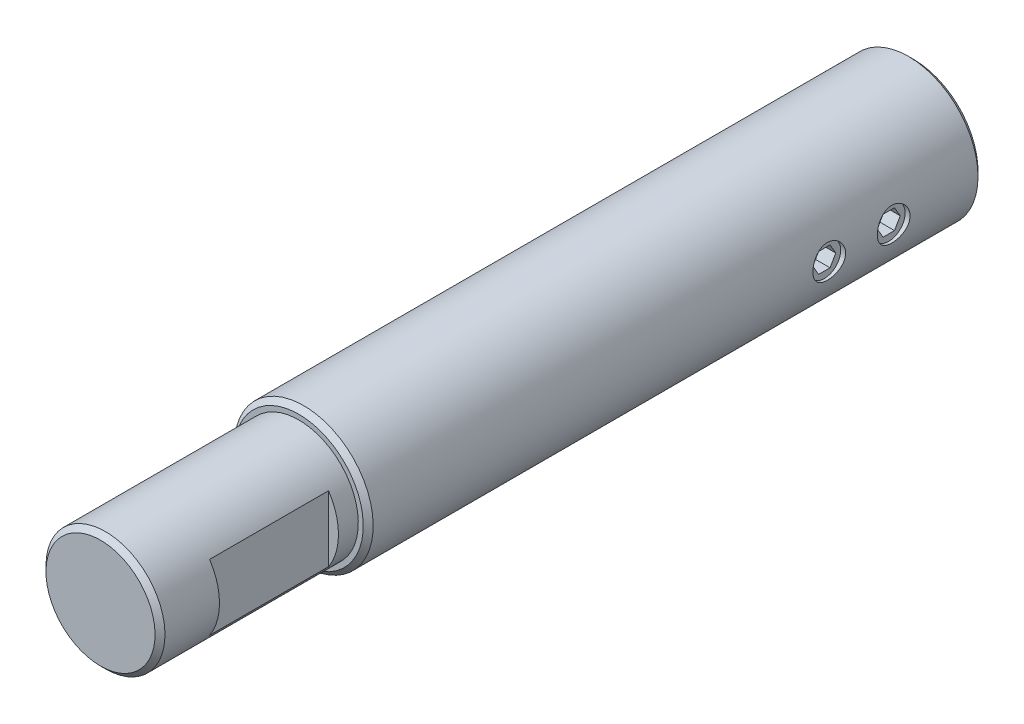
ISO-10303-21;
HEADER;
FILE_DESCRIPTION(('STEP AP214'),'2;1');
FILE_NAME('part.step','',(''),(''),'','','');
FILE_SCHEMA(('AUTOMOTIVE_DESIGN { 1 0 10303 214 1 1 1 1 }'));
ENDSEC;
DATA;
#1=APPLICATION_CONTEXT('core data for automotive mechanical design processes');
#2=APPLICATION_PROTOCOL_DEFINITION('international standard','automotive_design',2000,#1);
#3=PRODUCT_CONTEXT('',#1,'mechanical');
#4=PRODUCT('Part','Part','',(#3));
#5=PRODUCT_RELATED_PRODUCT_CATEGORY('part','',(#4));
#6=PRODUCT_DEFINITION_FORMATION('','',#4);
#7=PRODUCT_DEFINITION_CONTEXT('part definition',#1,'design');
#8=PRODUCT_DEFINITION('design','',#6,#7);
#9=PRODUCT_DEFINITION_SHAPE('','',#8);
#10=(LENGTH_UNIT() NAMED_UNIT(*) SI_UNIT(.MILLI.,.METRE.));
#11=(NAMED_UNIT(*) PLANE_ANGLE_UNIT() SI_UNIT($,.RADIAN.));
#12=(NAMED_UNIT(*) SI_UNIT($,.STERADIAN.) SOLID_ANGLE_UNIT());
#13=UNCERTAINTY_MEASURE_WITH_UNIT(LENGTH_MEASURE(1.E-05),#10,'distance_accuracy_value','');
#14=(GEOMETRIC_REPRESENTATION_CONTEXT(3) GLOBAL_UNCERTAINTY_ASSIGNED_CONTEXT((#13)) GLOBAL_UNIT_ASSIGNED_CONTEXT((#10,
#11,#12)) REPRESENTATION_CONTEXT('',''));
#15=CARTESIAN_POINT('',(0.,0.,0.));
#16=DIRECTION('',(0.,0.,1.));
#17=DIRECTION('',(1.,0.,0.));
#18=AXIS2_PLACEMENT_3D('',#15,#16,#17);
#19=CARTESIAN_POINT('',(0.,0.,0.));
#20=DIRECTION('',(0.,0.,-1.));
#21=DIRECTION('',(0.,-1.,0.));
#22=AXIS2_PLACEMENT_3D('',#19,#20,#21);
#23=CYLINDRICAL_SURFACE('',#22,6.);
#24=CARTESIAN_POINT('',(0.,0.,81.5));
#25=DIRECTION('',(0.,0.,-1.));
#26=DIRECTION('',(0.,-1.,0.));
#27=AXIS2_PLACEMENT_3D('',#24,#25,#26);
#28=CIRCLE('',#27,6.);
#29=CARTESIAN_POINT('',(0.,-6.,81.5));
#30=VERTEX_POINT('',#29);
#31=EDGE_CURVE('E435',#30,#30,#28,.T.);
#32=ORIENTED_EDGE('',*,*,#31,.T.);
#33=EDGE_LOOP('',(#32));
#34=FACE_BOUND('',#33,.T.);
#35=CARTESIAN_POINT('',(0.,0.,62.));
#36=DIRECTION('',(0.,0.,-1.));
#37=DIRECTION('',(0.,-1.,0.));
#38=AXIS2_PLACEMENT_3D('',#35,#36,#37);
#39=CIRCLE('',#38,6.);
#40=CARTESIAN_POINT('',(0.,-6.,62.));
#41=VERTEX_POINT('',#40);
#42=EDGE_CURVE('E456',#41,#41,#39,.T.);
#43=ORIENTED_EDGE('',*,*,#42,.F.);
#44=EDGE_LOOP('',(#43));
#45=FACE_BOUND('',#44,.T.);
#46=CARTESIAN_POINT('',(0.,0.,64.));
#47=DIRECTION('',(0.,0.,1.));
#48=DIRECTION('',(0.,1.,0.));
#49=AXIS2_PLACEMENT_3D('',#46,#47,#48);
#50=CIRCLE('',#49,6.);
#51=CARTESIAN_POINT('',(5.,-3.3166247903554,64.));
#52=VERTEX_POINT('',#51);
#53=CARTESIAN_POINT('',(5.,3.3166247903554,64.));
#54=VERTEX_POINT('',#53);
#55=EDGE_CURVE('E104',#52,#54,#50,.T.);
#56=ORIENTED_EDGE('',*,*,#55,.F.);
#57=DIRECTION('',(0.,0.,1.));
#58=VECTOR('',#57,1.);
#59=CARTESIAN_POINT('',(5.,-3.3166247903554,64.));
#60=LINE('',#59,#58);
#61=CARTESIAN_POINT('',(5.,-3.3166247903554,76.));
#62=VERTEX_POINT('',#61);
#63=EDGE_CURVE('E101',#52,#62,#60,.T.);
#64=ORIENTED_EDGE('',*,*,#63,.T.);
#65=CARTESIAN_POINT('',(0.,0.,76.));
#66=DIRECTION('',(0.,0.,1.));
#67=DIRECTION('',(0.,1.,0.));
#68=AXIS2_PLACEMENT_3D('',#65,#66,#67);
#69=CIRCLE('',#68,6.);
#70=CARTESIAN_POINT('',(5.,3.3166247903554,76.));
#71=VERTEX_POINT('',#70);
#72=EDGE_CURVE('E89',#62,#71,#69,.T.);
#73=ORIENTED_EDGE('',*,*,#72,.T.);
#74=DIRECTION('',(0.,0.,1.));
#75=VECTOR('',#74,1.);
#76=CARTESIAN_POINT('',(5.,3.3166247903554,64.));
#77=LINE('',#76,#75);
#78=EDGE_CURVE('E103',#54,#71,#77,.T.);
#79=ORIENTED_EDGE('',*,*,#78,.F.);
#80=EDGE_LOOP('',(#56,#64,#73,#79));
#81=FACE_BOUND('',#80,.T.);
#82=ADVANCED_FACE('F14',(#34,#45,#81),#23,.T.);
#83=CARTESIAN_POINT('',(0.,0.,0.));
#84=DIRECTION('',(0.,0.,-1.));
#85=DIRECTION('',(0.,-1.,0.));
#86=AXIS2_PLACEMENT_3D('',#83,#84,#85);
#87=CYLINDRICAL_SURFACE('',#86,7.);
#88=CARTESIAN_POINT('',(0.,0.,0.5));
#89=DIRECTION('',(0.,0.,1.));
#90=DIRECTION('',(0.,1.,0.));
#91=AXIS2_PLACEMENT_3D('',#88,#89,#90);
#92=CIRCLE('',#91,7.);
#93=CARTESIAN_POINT('',(0.,7.,0.5));
#94=VERTEX_POINT('',#93);
#95=EDGE_CURVE('E439',#94,#94,#92,.T.);
#96=ORIENTED_EDGE('',*,*,#95,.T.);
#97=EDGE_LOOP('',(#96));
#98=FACE_BOUND('',#97,.T.);
#99=CARTESIAN_POINT('',(0.,0.,61.5));
#100=DIRECTION('',(0.,0.,-1.));
#101=DIRECTION('',(0.,-1.,0.));
#102=AXIS2_PLACEMENT_3D('',#99,#100,#101);
#103=CIRCLE('',#102,7.);
#104=CARTESIAN_POINT('',(0.,-7.,61.5));
#105=VERTEX_POINT('',#104);
#106=EDGE_CURVE('E444',#105,#105,#103,.T.);
#107=ORIENTED_EDGE('',*,*,#106,.T.);
#108=EDGE_LOOP('',(#107));
#109=FACE_BOUND('',#108,.T.);
#110=CARTESIAN_POINT('',(6.80275679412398,1.65,9.));
#111=CARTESIAN_POINT('',(6.80275861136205,1.64999713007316,8.90871099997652));
#112=CARTESIAN_POINT('',(6.80461440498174,1.64239813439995,8.8173890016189));
#113=CARTESIAN_POINT('',(6.81182064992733,1.61224414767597,8.63735543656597));
#114=CARTESIAN_POINT('',(6.81717336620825,1.58967946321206,8.54864560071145));
#115=CARTESIAN_POINT('',(6.83073431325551,1.53035515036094,8.37646648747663));
#116=CARTESIAN_POINT('',(6.83893911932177,1.49361254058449,8.2929910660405));
#117=CARTESIAN_POINT('',(6.85727558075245,1.40702581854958,8.13338346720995));
#118=CARTESIAN_POINT('',(6.86740726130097,1.3571815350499,8.05725138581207));
#119=CARTESIAN_POINT('',(6.88867782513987,1.24476461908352,7.91300017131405));
#120=CARTESIAN_POINT('',(6.89983131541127,1.18198309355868,7.84504595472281));
#121=CARTESIAN_POINT('',(6.92176152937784,1.04592427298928,7.72052828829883));
#122=CARTESIAN_POINT('',(6.93253822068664,0.972646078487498,7.66396581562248));
#123=CARTESIAN_POINT('',(6.95266103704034,0.816555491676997,7.56317303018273));
#124=CARTESIAN_POINT('',(6.96198791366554,0.733636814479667,7.51910313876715));
#125=CARTESIAN_POINT('',(6.97799434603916,0.561312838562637,7.44558709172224));
#126=CARTESIAN_POINT('',(6.98467424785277,0.471908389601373,7.41613902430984));
#127=CARTESIAN_POINT('',(6.99453084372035,0.290868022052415,7.37322629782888));
#128=CARTESIAN_POINT('',(6.99776875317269,0.199301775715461,7.35948200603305));
#129=CARTESIAN_POINT('',(7.00058928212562,0.0151097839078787,7.34749086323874));
#130=CARTESIAN_POINT('',(7.00017238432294,-0.0775158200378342,7.34924196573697));
#131=CARTESIAN_POINT('',(6.99577641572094,-0.259263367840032,7.36798740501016));
#132=CARTESIAN_POINT('',(6.99186783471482,-0.348418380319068,7.38468011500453));
#133=CARTESIAN_POINT('',(6.98100889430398,-0.52262462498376,7.43235207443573));
#134=CARTESIAN_POINT('',(6.97405838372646,-0.607675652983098,7.46333203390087));
#135=CARTESIAN_POINT('',(6.95778608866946,-0.77207438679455,7.53895377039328));
#136=CARTESIAN_POINT('',(6.94844521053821,-0.851369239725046,7.58370617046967));
#137=CARTESIAN_POINT('',(6.92841069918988,-1.00143136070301,7.68551922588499));
#138=CARTESIAN_POINT('',(6.91771685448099,-1.07219729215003,7.74258180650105));
#139=CARTESIAN_POINT('',(6.89584251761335,-1.20498965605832,7.86902452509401));
#140=CARTESIAN_POINT('',(6.884656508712,-1.26676421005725,7.93866849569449));
#141=CARTESIAN_POINT('',(6.8632971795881,-1.37780936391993,8.0874443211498));
#142=CARTESIAN_POINT('',(6.85312389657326,-1.42707950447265,8.16657652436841));
#143=CARTESIAN_POINT('',(6.83492437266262,-1.51185477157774,8.33253525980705));
#144=CARTESIAN_POINT('',(6.82690665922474,-1.54730546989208,8.41939059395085));
#145=CARTESIAN_POINT('',(6.8140390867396,-1.6030277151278,8.59806127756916));
#146=CARTESIAN_POINT('',(6.80918863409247,-1.62330210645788,8.68987569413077));
#147=CARTESIAN_POINT('',(6.80332774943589,-1.64769127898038,8.87353855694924));
#148=CARTESIAN_POINT('',(6.80222947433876,-1.65217579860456,8.96533515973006));
#149=CARTESIAN_POINT('',(6.80375919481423,-1.64586488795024,9.14836457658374));
#150=CARTESIAN_POINT('',(6.80638688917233,-1.63507069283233,9.23959743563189));
#151=CARTESIAN_POINT('',(6.81498886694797,-1.59883140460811,9.41757745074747));
#152=CARTESIAN_POINT('',(6.82091521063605,-1.57359604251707,9.50436984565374));
#153=CARTESIAN_POINT('',(6.83540229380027,-1.50942069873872,9.67249368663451));
#154=CARTESIAN_POINT('',(6.84396331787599,-1.47047923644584,9.75382454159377));
#155=CARTESIAN_POINT('',(6.86294389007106,-1.37920410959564,9.91029905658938));
#156=CARTESIAN_POINT('',(6.87339357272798,-1.32664621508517,9.98530818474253));
#157=CARTESIAN_POINT('',(6.89489755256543,-1.20991829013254,10.1255780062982));
#158=CARTESIAN_POINT('',(6.90595193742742,-1.14574657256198,10.1908372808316));
#159=CARTESIAN_POINT('',(6.92771364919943,-1.00592681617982,10.3112229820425));
#160=CARTESIAN_POINT('',(6.93840801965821,-0.930057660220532,10.3660953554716));
#161=CARTESIAN_POINT('',(6.95799159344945,-0.769965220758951,10.4623180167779));
#162=CARTESIAN_POINT('',(6.96688088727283,-0.685742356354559,10.503668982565));
#163=CARTESIAN_POINT('',(6.9817988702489,-0.511894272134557,10.5713378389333));
#164=CARTESIAN_POINT('',(6.98784709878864,-0.422310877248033,10.5977586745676));
#165=CARTESIAN_POINT('',(6.99648655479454,-0.239816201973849,10.6351328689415));
#166=CARTESIAN_POINT('',(6.99907837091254,-0.146905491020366,10.6460888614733));
#167=CARTESIAN_POINT('',(7.00049202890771,0.0372082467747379,10.6520881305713));
#168=CARTESIAN_POINT('',(6.9994031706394,0.128398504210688,10.647508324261));
#169=CARTESIAN_POINT('',(6.99377268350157,0.308670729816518,10.6234197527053));
#170=CARTESIAN_POINT('',(6.98923113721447,0.397752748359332,10.6039113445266));
#171=CARTESIAN_POINT('',(6.97721604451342,0.570933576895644,10.5507117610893));
#172=CARTESIAN_POINT('',(6.96975517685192,0.655052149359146,10.5170818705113));
#173=CARTESIAN_POINT('',(6.95269208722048,0.81649879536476,10.4366509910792));
#174=CARTESIAN_POINT('',(6.94308962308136,0.893826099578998,10.3898485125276));
#175=CARTESIAN_POINT('',(6.92252474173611,1.04130725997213,10.2832139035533));
#176=CARTESIAN_POINT('',(6.91153737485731,1.11126948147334,10.2231215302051));
#177=CARTESIAN_POINT('',(6.88956325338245,1.24024523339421,10.0921276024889));
#178=CARTESIAN_POINT('',(6.8785764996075,1.29925605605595,10.0212233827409));
#179=CARTESIAN_POINT('',(6.85764827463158,1.40557849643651,9.86924540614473));
#180=CARTESIAN_POINT('',(6.84772646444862,1.45268661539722,9.7880263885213));
#181=CARTESIAN_POINT('',(6.83030721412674,1.53250931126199,9.61860266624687));
#182=CARTESIAN_POINT('',(6.82280787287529,1.56523518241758,9.53040350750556));
#183=CARTESIAN_POINT('',(6.81235745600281,1.61002842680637,9.36853084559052));
#184=CARTESIAN_POINT('',(6.80878274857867,1.62498700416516,9.29568399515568));
#185=CARTESIAN_POINT('',(6.8039817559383,1.64497362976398,9.14856531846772));
#186=CARTESIAN_POINT('',(6.80275531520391,1.65000233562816,9.07429358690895));
#187=CARTESIAN_POINT('',(6.80275679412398,1.65,9.));
#188=B_SPLINE_CURVE_WITH_KNOTS('',3,(#110,#111,#112,#113,#114,#115,#116,#117,#118,#119,#120,
#121,#122,#123,#124,#125,#126,#127,#128,#129,#130,#131,#132,#133,#134,#135,#136,#137,#138,#139,
#140,#141,#142,#143,#144,#145,#146,#147,#148,#149,#150,#151,#152,#153,#154,#155,#156,#157,#158,
#159,#160,#161,#162,#163,#164,#165,#166,#167,#168,#169,#170,#171,#172,#173,#174,#175,#176,#177,
#178,#179,#180,#181,#182,#183,#184,#185,#186,#187),.UNSPECIFIED.,.T.,.F.,(4,2,2,2,2,2,2,2,2,2,2,
2,2,2,2,2,2,2,2,2,2,2,2,2,2,2,2,2,2,2,2,2,2,2,2,2,2,2,4),(0.,0.273594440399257,
0.547366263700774,0.820810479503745,1.0942582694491,1.37252656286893,1.65081871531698,
1.9325374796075,2.21421939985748,2.49080324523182,2.76735056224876,3.03843805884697,
3.30953902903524,3.58287702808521,3.85625780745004,4.13623055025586,4.41621357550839,
4.69728844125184,4.97831061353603,5.25270687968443,5.52708096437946,5.79756789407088,
6.06808405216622,6.34337456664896,6.61870510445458,6.90008328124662,7.18144734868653,
7.46084693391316,7.74019892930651,8.01282246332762,8.28543947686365,8.55688541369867,
8.82836206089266,9.10571835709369,9.38314313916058,9.66503130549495,9.9466977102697,
10.1693714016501,10.3920303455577),.UNSPECIFIED.);
#189=CARTESIAN_POINT('',(6.80275679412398,1.65,9.));
#190=VERTEX_POINT('',#189);
#191=EDGE_CURVE('E107',#190,#190,#188,.T.);
#192=ORIENTED_EDGE('',*,*,#191,.T.);
#193=EDGE_LOOP('',(#192));
#194=FACE_BOUND('',#193,.T.);
#195=CARTESIAN_POINT('',(6.80275679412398,1.65,15.5));
#196=CARTESIAN_POINT('',(6.80275861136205,1.64999713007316,15.4087109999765));
#197=CARTESIAN_POINT('',(6.80461440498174,1.64239813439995,15.3173890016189));
#198=CARTESIAN_POINT('',(6.81182064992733,1.61224414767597,15.137355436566));
#199=CARTESIAN_POINT('',(6.81717336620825,1.58967946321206,15.0486456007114));
#200=CARTESIAN_POINT('',(6.83073431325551,1.53035515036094,14.8764664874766));
#201=CARTESIAN_POINT('',(6.83893911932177,1.49361254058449,14.7929910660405));
#202=CARTESIAN_POINT('',(6.85727558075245,1.40702581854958,14.63338346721));
#203=CARTESIAN_POINT('',(6.86740726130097,1.3571815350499,14.5572513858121));
#204=CARTESIAN_POINT('',(6.88867782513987,1.24476461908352,14.4130001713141));
#205=CARTESIAN_POINT('',(6.89983131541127,1.18198309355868,14.3450459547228));
#206=CARTESIAN_POINT('',(6.92176152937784,1.04592427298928,14.2205282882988));
#207=CARTESIAN_POINT('',(6.93253822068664,0.972646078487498,14.1639658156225));
#208=CARTESIAN_POINT('',(6.95266103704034,0.816555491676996,14.0631730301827));
#209=CARTESIAN_POINT('',(6.96198791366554,0.733636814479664,14.0191031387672));
#210=CARTESIAN_POINT('',(6.97799434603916,0.561312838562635,13.9455870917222));
#211=CARTESIAN_POINT('',(6.98467424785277,0.471908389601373,13.9161390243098));
#212=CARTESIAN_POINT('',(6.99453084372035,0.290868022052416,13.8732262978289));
#213=CARTESIAN_POINT('',(6.99776875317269,0.199301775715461,13.859482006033));
#214=CARTESIAN_POINT('',(7.00058928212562,0.0151097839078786,13.8474908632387));
#215=CARTESIAN_POINT('',(7.00017238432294,-0.077515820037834,13.849241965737));
#216=CARTESIAN_POINT('',(6.99577641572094,-0.259263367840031,13.8679874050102));
#217=CARTESIAN_POINT('',(6.99186783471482,-0.348418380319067,13.8846801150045));
#218=CARTESIAN_POINT('',(6.98100889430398,-0.522624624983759,13.9323520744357));
#219=CARTESIAN_POINT('',(6.97405838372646,-0.607675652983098,13.9633320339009));
#220=CARTESIAN_POINT('',(6.95778608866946,-0.772074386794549,14.0389537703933));
#221=CARTESIAN_POINT('',(6.94844521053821,-0.851369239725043,14.0837061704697));
#222=CARTESIAN_POINT('',(6.92841069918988,-1.001431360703,14.185519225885));
#223=CARTESIAN_POINT('',(6.91771685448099,-1.07219729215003,14.242581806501));
#224=CARTESIAN_POINT('',(6.89584251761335,-1.20498965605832,14.369024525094));
#225=CARTESIAN_POINT('',(6.88465650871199,-1.26676421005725,14.4386684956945));
#226=CARTESIAN_POINT('',(6.8632971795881,-1.37780936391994,14.5874443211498));
#227=CARTESIAN_POINT('',(6.85312389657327,-1.42707950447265,14.6665765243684));
#228=CARTESIAN_POINT('',(6.83492437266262,-1.51185477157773,14.8325352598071));
#229=CARTESIAN_POINT('',(6.82690665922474,-1.54730546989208,14.9193905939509));
#230=CARTESIAN_POINT('',(6.8140390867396,-1.6030277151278,15.0980612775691));
#231=CARTESIAN_POINT('',(6.80918863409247,-1.62330210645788,15.1898756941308));
#232=CARTESIAN_POINT('',(6.80332774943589,-1.64769127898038,15.3735385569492));
#233=CARTESIAN_POINT('',(6.80222947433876,-1.65217579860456,15.4653351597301));
#234=CARTESIAN_POINT('',(6.80375919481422,-1.64586488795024,15.6483645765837));
#235=CARTESIAN_POINT('',(6.80638688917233,-1.63507069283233,15.7395974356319));
#236=CARTESIAN_POINT('',(6.81498886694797,-1.59883140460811,15.9175774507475));
#237=CARTESIAN_POINT('',(6.82091521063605,-1.57359604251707,16.0043698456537));
#238=CARTESIAN_POINT('',(6.83540229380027,-1.50942069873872,16.1724936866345));
#239=CARTESIAN_POINT('',(6.843963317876,-1.47047923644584,16.2538245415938));
#240=CARTESIAN_POINT('',(6.86294389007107,-1.37920410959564,16.4102990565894));
#241=CARTESIAN_POINT('',(6.87339357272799,-1.32664621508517,16.4853081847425));
#242=CARTESIAN_POINT('',(6.89489755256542,-1.20991829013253,16.6255780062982));
#243=CARTESIAN_POINT('',(6.90595193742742,-1.14574657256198,16.6908372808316));
#244=CARTESIAN_POINT('',(6.92771364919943,-1.00592681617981,16.8112229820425));
#245=CARTESIAN_POINT('',(6.93840801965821,-0.930057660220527,16.8660953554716));
#246=CARTESIAN_POINT('',(6.95799159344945,-0.769965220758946,16.9623180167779));
#247=CARTESIAN_POINT('',(6.96688088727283,-0.685742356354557,17.003668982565));
#248=CARTESIAN_POINT('',(6.9817988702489,-0.511894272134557,17.0713378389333));
#249=CARTESIAN_POINT('',(6.98784709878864,-0.422310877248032,17.0977586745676));
#250=CARTESIAN_POINT('',(6.99648655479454,-0.239816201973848,17.1351328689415));
#251=CARTESIAN_POINT('',(6.99907837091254,-0.146905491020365,17.1460888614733));
#252=CARTESIAN_POINT('',(7.00049202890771,0.0372082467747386,17.1520881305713));
#253=CARTESIAN_POINT('',(6.9994031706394,0.12839850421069,17.147508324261));
#254=CARTESIAN_POINT('',(6.99377268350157,0.30867072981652,17.1234197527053));
#255=CARTESIAN_POINT('',(6.98923113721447,0.397752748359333,17.1039113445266));
#256=CARTESIAN_POINT('',(6.97721604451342,0.570933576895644,17.0507117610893));
#257=CARTESIAN_POINT('',(6.96975517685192,0.655052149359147,17.0170818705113));
#258=CARTESIAN_POINT('',(6.95269208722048,0.816498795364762,16.9366509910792));
#259=CARTESIAN_POINT('',(6.94308962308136,0.893826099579,16.8898485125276));
#260=CARTESIAN_POINT('',(6.92252474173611,1.04130725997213,16.7832139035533));
#261=CARTESIAN_POINT('',(6.91153737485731,1.11126948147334,16.7231215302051));
#262=CARTESIAN_POINT('',(6.88956325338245,1.24024523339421,16.5921276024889));
#263=CARTESIAN_POINT('',(6.87857649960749,1.29925605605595,16.5212233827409));
#264=CARTESIAN_POINT('',(6.85764827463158,1.40557849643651,16.3692454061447));
#265=CARTESIAN_POINT('',(6.84772646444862,1.45268661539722,16.2880263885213));
#266=CARTESIAN_POINT('',(6.83030721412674,1.53250931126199,16.1186026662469));
#267=CARTESIAN_POINT('',(6.82280787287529,1.56523518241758,16.0304035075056));
#268=CARTESIAN_POINT('',(6.81235745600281,1.61002842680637,15.8685308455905));
#269=CARTESIAN_POINT('',(6.80878274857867,1.62498700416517,15.7956839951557));
#270=CARTESIAN_POINT('',(6.8039817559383,1.64497362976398,15.6485653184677));
#271=CARTESIAN_POINT('',(6.80275531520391,1.65000233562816,15.574293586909));
#272=CARTESIAN_POINT('',(6.80275679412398,1.65,15.5));
#273=B_SPLINE_CURVE_WITH_KNOTS('',3,(#195,#196,#197,#198,#199,#200,#201,#202,#203,#204,#205,
#206,#207,#208,#209,#210,#211,#212,#213,#214,#215,#216,#217,#218,#219,#220,#221,#222,#223,#224,
#225,#226,#227,#228,#229,#230,#231,#232,#233,#234,#235,#236,#237,#238,#239,#240,#241,#242,#243,
#244,#245,#246,#247,#248,#249,#250,#251,#252,#253,#254,#255,#256,#257,#258,#259,#260,#261,#262,
#263,#264,#265,#266,#267,#268,#269,#270,#271,#272),.UNSPECIFIED.,.T.,.F.,(4,2,2,2,2,2,2,2,2,2,2,
2,2,2,2,2,2,2,2,2,2,2,2,2,2,2,2,2,2,2,2,2,2,2,2,2,2,2,4),(0.,0.273594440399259,
0.547366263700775,0.820810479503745,1.0942582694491,1.37252656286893,1.65081871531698,
1.9325374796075,2.21421939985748,2.49080324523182,2.76735056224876,3.03843805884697,
3.30953902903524,3.5828770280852,3.85625780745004,4.13623055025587,4.4162135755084,
4.69728844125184,4.97831061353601,5.25270687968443,5.52708096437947,5.79756789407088,
6.06808405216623,6.34337456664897,6.61870510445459,6.90008328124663,7.18144734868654,
7.46084693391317,7.74019892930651,8.01282246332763,8.28543947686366,8.55688541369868,
8.82836206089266,9.10571835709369,9.38314313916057,9.66503130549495,9.94669771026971,
10.1693714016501,10.3920303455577),.UNSPECIFIED.);
#274=CARTESIAN_POINT('',(6.80275679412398,1.65,15.5));
#275=VERTEX_POINT('',#274);
#276=EDGE_CURVE('E110',#275,#275,#273,.T.);
#277=ORIENTED_EDGE('',*,*,#276,.T.);
#278=EDGE_LOOP('',(#277));
#279=FACE_BOUND('',#278,.T.);
#280=ADVANCED_FACE('F125',(#98,#109,#194,#279),#87,.T.);
#281=CARTESIAN_POINT('',(-6.,0.,82.));
#282=DIRECTION('',(0.,0.,-1.));
#283=DIRECTION('',(0.,-1.,0.));
#284=AXIS2_PLACEMENT_3D('',#281,#282,#283);
#285=PLANE('',#284);
#286=CARTESIAN_POINT('',(0.,0.,82.));
#287=DIRECTION('',(0.,0.,-1.));
#288=DIRECTION('',(0.,-1.,0.));
#289=AXIS2_PLACEMENT_3D('',#286,#287,#288);
#290=CIRCLE('',#289,5.5);
#291=CARTESIAN_POINT('',(0.,-5.5,82.));
#292=VERTEX_POINT('',#291);
#293=EDGE_CURVE('E431',#292,#292,#290,.F.);
#294=ORIENTED_EDGE('',*,*,#293,.T.);
#295=EDGE_LOOP('',(#294));
#296=FACE_BOUND('',#295,.T.);
#297=ADVANCED_FACE('F467',(#296),#285,.F.);
#298=CARTESIAN_POINT('',(-7.,0.,62.));
#299=DIRECTION('',(0.,0.,-1.));
#300=DIRECTION('',(0.,-1.,0.));
#301=AXIS2_PLACEMENT_3D('',#298,#299,#300);
#302=PLANE('',#301);
#303=CARTESIAN_POINT('',(0.,0.,62.));
#304=DIRECTION('',(0.,0.,-1.));
#305=DIRECTION('',(0.,-1.,0.));
#306=AXIS2_PLACEMENT_3D('',#303,#304,#305);
#307=CIRCLE('',#306,6.5);
#308=CARTESIAN_POINT('',(0.,-6.5,62.));
#309=VERTEX_POINT('',#308);
#310=EDGE_CURVE('E18',#309,#309,#307,.F.);
#311=ORIENTED_EDGE('',*,*,#310,.T.);
#312=EDGE_LOOP('',(#311));
#313=FACE_BOUND('',#312,.T.);
#314=ORIENTED_EDGE('',*,*,#42,.T.);
#315=EDGE_LOOP('',(#314));
#316=FACE_BOUND('',#315,.T.);
#317=ADVANCED_FACE('F473',(#313,#316),#302,.F.);
#318=CARTESIAN_POINT('',(-4.,0.,0.));
#319=DIRECTION('',(0.,0.,1.));
#320=DIRECTION('',(0.,1.,0.));
#321=AXIS2_PLACEMENT_3D('',#318,#319,#320);
#322=PLANE('',#321);
#323=CARTESIAN_POINT('',(0.,0.,0.));
#324=DIRECTION('',(0.,0.,1.));
#325=DIRECTION('',(0.,1.,0.));
#326=AXIS2_PLACEMENT_3D('',#323,#324,#325);
#327=CIRCLE('',#326,6.5);
#328=CARTESIAN_POINT('',(0.,6.5,0.));
#329=VERTEX_POINT('',#328);
#330=EDGE_CURVE('E447',#329,#329,#327,.F.);
#331=ORIENTED_EDGE('',*,*,#330,.T.);
#332=EDGE_LOOP('',(#331));
#333=FACE_BOUND('',#332,.T.);
#334=CARTESIAN_POINT('',(0.,0.,0.));
#335=DIRECTION('',(0.,0.,1.));
#336=DIRECTION('',(0.,1.,0.));
#337=AXIS2_PLACEMENT_3D('',#334,#335,#336);
#338=CIRCLE('',#337,4.57735026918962);
#339=CARTESIAN_POINT('',(0.,4.57735026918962,0.));
#340=VERTEX_POINT('',#339);
#341=EDGE_CURVE('E450',#340,#340,#338,.T.);
#342=ORIENTED_EDGE('',*,*,#341,.T.);
#343=EDGE_LOOP('',(#342));
#344=FACE_BOUND('',#343,.T.);
#345=ADVANCED_FACE('F143',(#333,#344),#322,.F.);
#346=CARTESIAN_POINT('',(0.,0.,0.));
#347=DIRECTION('',(0.,0.,-1.));
#348=DIRECTION('',(0.,-1.,0.));
#349=AXIS2_PLACEMENT_3D('',#346,#347,#348);
#350=CYLINDRICAL_SURFACE('',#349,4.);
#351=CARTESIAN_POINT('',(4.,0.,7.));
#352=CARTESIAN_POINT('',(3.99999426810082,-0.105143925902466,7.00000660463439));
#353=CARTESIAN_POINT('',(3.99580982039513,-0.210413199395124,7.00834014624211));
#354=CARTESIAN_POINT('',(3.97948312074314,-0.417840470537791,7.04130576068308));
#355=CARTESIAN_POINT('',(3.96732575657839,-0.519992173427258,7.06596878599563));
#356=CARTESIAN_POINT('',(3.93632558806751,-0.717867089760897,7.13038761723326));
#357=CARTESIAN_POINT('',(3.91750878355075,-0.813613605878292,7.17008476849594));
#358=CARTESIAN_POINT('',(3.87491553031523,-0.996945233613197,7.26314124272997));
#359=CARTESIAN_POINT('',(3.85113947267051,-1.08453098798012,7.31649948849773));
#360=CARTESIAN_POINT('',(3.79912516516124,-1.25501563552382,7.43903449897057));
#361=CARTESIAN_POINT('',(3.77070398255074,-1.33731042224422,7.50897295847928));
#362=CARTESIAN_POINT('',(3.71319940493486,-1.48955888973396,7.66104295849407));
#363=CARTESIAN_POINT('',(3.68411552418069,-1.55950316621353,7.74318370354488));
#364=CARTESIAN_POINT('',(3.62597902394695,-1.69050400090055,7.92496669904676));
#365=CARTESIAN_POINT('',(3.59710373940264,-1.75045067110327,8.02547219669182));
#366=CARTESIAN_POINT('',(3.54571957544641,-1.85233645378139,8.23673467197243));
#367=CARTESIAN_POINT('',(3.52320615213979,-1.89428842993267,8.34748425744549));
#368=CARTESIAN_POINT('',(3.48915734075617,-1.95626488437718,8.56933021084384));
#369=CARTESIAN_POINT('',(3.47704543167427,-1.97745171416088,8.68000890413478));
#370=CARTESIAN_POINT('',(3.46363779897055,-2.00085398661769,8.90395767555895));
#371=CARTESIAN_POINT('',(3.46233138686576,-2.00308817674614,9.01722508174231));
#372=CARTESIAN_POINT('',(3.47021860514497,-1.98937457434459,9.22857204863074));
#373=CARTESIAN_POINT('',(3.47817527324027,-1.97556911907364,9.3268480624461));
#374=CARTESIAN_POINT('',(3.50152457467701,-1.93387969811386,9.51944381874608));
#375=CARTESIAN_POINT('',(3.51691957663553,-1.9059912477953,9.61376229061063));
#376=CARTESIAN_POINT('',(3.55374952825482,-1.83641956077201,9.79845826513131));
#377=CARTESIAN_POINT('',(3.57531681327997,-1.79443013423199,9.88869279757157));
#378=CARTESIAN_POINT('',(3.62206808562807,-1.69808337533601,10.06126858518));
#379=CARTESIAN_POINT('',(3.64725369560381,-1.64372048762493,10.1436062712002));
#380=CARTESIAN_POINT('',(3.70226315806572,-1.51613210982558,10.3090425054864));
#381=CARTESIAN_POINT('',(3.73227020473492,-1.44138891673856,10.3909137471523));
#382=CARTESIAN_POINT('',(3.79095246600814,-1.27911115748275,10.5414708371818));
#383=CARTESIAN_POINT('',(3.81962703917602,-1.19157051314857,10.6101503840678));
#384=CARTESIAN_POINT('',(3.87403974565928,-1.0010330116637,10.7353713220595));
#385=CARTESIAN_POINT('',(3.89957968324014,-0.897507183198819,10.7912009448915));
#386=CARTESIAN_POINT('',(3.94315762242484,-0.680932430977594,10.884194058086));
#387=CARTESIAN_POINT('',(3.96120157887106,-0.567891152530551,10.9213723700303));
#388=CARTESIAN_POINT('',(3.98648667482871,-0.345532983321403,10.9729508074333));
#389=CARTESIAN_POINT('',(3.9944987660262,-0.236683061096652,10.9889824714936));
#390=CARTESIAN_POINT('',(4.00146026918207,-0.0175591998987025,11.002929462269));
#391=CARTESIAN_POINT('',(4.00041397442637,0.0927140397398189,11.0008533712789));
#392=CARTESIAN_POINT('',(3.9898238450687,0.302465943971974,10.9795866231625));
#393=CARTESIAN_POINT('',(3.98094491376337,0.402118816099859,10.96173493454));
#394=CARTESIAN_POINT('',(3.9564434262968,0.596813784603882,10.9115238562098));
#395=CARTESIAN_POINT('',(3.94082012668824,0.691855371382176,10.879162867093));
#396=CARTESIAN_POINT('',(3.90368502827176,0.877777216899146,10.8000030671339));
#397=CARTESIAN_POINT('',(3.88201763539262,0.968460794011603,10.7528178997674));
#398=CARTESIAN_POINT('',(3.83487948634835,1.14092272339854,10.6457849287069));
#399=CARTESIAN_POINT('',(3.80940711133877,1.22269725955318,10.5859317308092));
#400=CARTESIAN_POINT('',(3.75416442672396,1.38353537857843,10.4484791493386));
#401=CARTESIAN_POINT('',(3.72421769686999,1.46154415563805,10.3697142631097));
#402=CARTESIAN_POINT('',(3.6652478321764,1.60371264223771,10.2001496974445));
#403=CARTESIAN_POINT('',(3.63622534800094,1.66786277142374,10.1093417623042));
#404=CARTESIAN_POINT('',(3.58102384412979,1.78341582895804,9.91271269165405));
#405=CARTESIAN_POINT('',(3.55505059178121,1.8340509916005,9.80637746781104));
#406=CARTESIAN_POINT('',(3.51148144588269,1.91616565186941,9.58497986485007));
#407=CARTESIAN_POINT('',(3.493874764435,1.94766983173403,9.46992894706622));
#408=CARTESIAN_POINT('',(3.47123002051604,1.98772337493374,9.24617955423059));
#409=CARTESIAN_POINT('',(3.4651476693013,1.9981859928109,9.13793149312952));
#410=CARTESIAN_POINT('',(3.46330709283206,2.00137830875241,8.92110586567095));
#411=CARTESIAN_POINT('',(3.4675443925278,1.99411569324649,8.81252846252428));
#412=CARTESIAN_POINT('',(3.48475724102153,1.96385225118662,8.60903299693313));
#413=CARTESIAN_POINT('',(3.49686188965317,1.94241662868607,8.51379905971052));
#414=CARTESIAN_POINT('',(3.52742032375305,1.88635071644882,8.32838376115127));
#415=CARTESIAN_POINT('',(3.54587615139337,1.85171618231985,8.23820403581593));
#416=CARTESIAN_POINT('',(3.58857060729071,1.76763149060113,8.05875029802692));
#417=CARTESIAN_POINT('',(3.61311444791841,1.7173422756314,7.96994419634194));
#418=CARTESIAN_POINT('',(3.66470663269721,1.60430194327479,7.80145092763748));
#419=CARTESIAN_POINT('',(3.69175627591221,1.54154434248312,7.72176853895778));
#420=CARTESIAN_POINT('',(3.74924646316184,1.39640665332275,7.56371603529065));
#421=CARTESIAN_POINT('',(3.77969966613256,1.31256884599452,7.48668179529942));
#422=CARTESIAN_POINT('',(3.83755504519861,1.1323096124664,7.34747403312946));
#423=CARTESIAN_POINT('',(3.8649555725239,1.0358814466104,7.28530852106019));
#424=CARTESIAN_POINT('',(3.91396019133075,0.831863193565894,7.17752727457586));
#425=CARTESIAN_POINT('',(3.93552192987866,0.724199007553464,7.13203166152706));
#426=CARTESIAN_POINT('',(3.97002682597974,0.501484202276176,7.06038366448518));
#427=CARTESIAN_POINT('',(3.98299446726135,0.386455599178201,7.03417630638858));
#428=CARTESIAN_POINT('',(3.99390923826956,0.225203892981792,7.01220517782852));
#429=CARTESIAN_POINT('',(3.99618730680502,0.180323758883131,7.00763471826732));
#430=CARTESIAN_POINT('',(3.99923393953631,0.0903034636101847,7.00153066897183));
#431=CARTESIAN_POINT('',(4.00000246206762,0.0451632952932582,6.99999716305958));
#432=CARTESIAN_POINT('',(4.,0.,7.));
#433=B_SPLINE_CURVE_WITH_KNOTS('',3,(#351,#352,#353,#354,#355,#356,#357,#358,#359,#360,#361,
#362,#363,#364,#365,#366,#367,#368,#369,#370,#371,#372,#373,#374,#375,#376,#377,#378,#379,#380,
#381,#382,#383,#384,#385,#386,#387,#388,#389,#390,#391,#392,#393,#394,#395,#396,#397,#398,#399,
#400,#401,#402,#403,#404,#405,#406,#407,#408,#409,#410,#411,#412,#413,#414,#415,#416,#417,#418,
#419,#420,#421,#422,#423,#424,#425,#426,#427,#428,#429,#430,#431,#432),.UNSPECIFIED.,.T.,.F.,(4,
2,2,2,2,2,2,2,2,2,2,2,2,2,2,2,2,2,2,2,2,2,2,2,2,2,2,2,2,2,2,2,2,2,2,2,2,2,2,2,4),(0.,
0.315248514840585,0.631096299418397,0.945724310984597,1.26032752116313,1.59396351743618,
1.92785247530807,2.28763452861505,2.64715895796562,2.98516024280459,3.32282714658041,
3.62011424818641,3.91749607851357,4.22180480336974,4.52625042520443,4.86929882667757,
5.21251069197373,5.57166044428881,5.93052433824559,6.25966580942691,6.58865129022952,
6.89213813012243,7.19565843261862,7.50785712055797,7.82018901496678,8.16319221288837,
8.50643177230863,8.86629364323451,9.22569023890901,9.55058615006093,9.87534119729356,
10.1691586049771,10.463070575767,10.7767291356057,11.0905512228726,11.4425048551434,
11.7946476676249,12.1492802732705,12.502898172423,12.6383056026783,12.7737167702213),.UNSPECIFIED.);
#434=CARTESIAN_POINT('',(4.,0.,7.));
#435=VERTEX_POINT('',#434);
#436=EDGE_CURVE('E9',#435,#435,#433,.T.);
#437=ORIENTED_EDGE('',*,*,#436,.F.);
#438=EDGE_LOOP('',(#437));
#439=FACE_BOUND('',#438,.T.);
#440=CARTESIAN_POINT('',(3.60555127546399,-1.73205080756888,16.5));
#441=CARTESIAN_POINT('',(3.63330072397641,-1.6742839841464,16.6000507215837));
#442=CARTESIAN_POINT('',(3.66340889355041,-1.60804520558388,16.6947282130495));
#443=CARTESIAN_POINT('',(3.72473015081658,-1.46040741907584,16.8713190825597));
#444=CARTESIAN_POINT('',(3.75594606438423,-1.37896698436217,16.9531964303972));
#445=CARTESIAN_POINT('',(3.81605659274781,-1.20265571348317,17.1021634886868));
#446=CARTESIAN_POINT('',(3.84495025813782,-1.10777942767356,17.1692471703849));
#447=CARTESIAN_POINT('',(3.8972467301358,-0.906764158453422,17.286416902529));
#448=CARTESIAN_POINT('',(3.92065575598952,-0.800638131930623,17.3365222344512));
#449=CARTESIAN_POINT('',(3.9585333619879,-0.584425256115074,17.416026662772));
#450=CARTESIAN_POINT('',(3.97332921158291,-0.474679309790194,17.4461906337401));
#451=CARTESIAN_POINT('',(3.99370450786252,-0.250836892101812,17.4874624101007));
#452=CARTESIAN_POINT('',(3.99928959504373,-0.136743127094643,17.4985818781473));
#453=CARTESIAN_POINT('',(4.00052059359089,0.0805769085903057,17.501038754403));
#454=CARTESIAN_POINT('',(3.99707902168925,0.183782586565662,17.4941923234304));
#455=CARTESIAN_POINT('',(3.98250691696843,0.387363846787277,17.4648216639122));
#456=CARTESIAN_POINT('',(3.97137663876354,0.487739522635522,17.4422979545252));
#457=CARTESIAN_POINT('',(3.94266442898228,0.681856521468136,17.3828878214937));
#458=CARTESIAN_POINT('',(3.92515694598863,0.775660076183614,17.3461668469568));
#459=CARTESIAN_POINT('',(3.88520912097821,0.955865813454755,17.259636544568));
#460=CARTESIAN_POINT('',(3.86276744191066,1.04226598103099,17.2098236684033));
#461=CARTESIAN_POINT('',(3.812752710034,1.21304818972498,17.0937543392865));
#462=CARTESIAN_POINT('',(3.78490681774,1.29664921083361,17.0264671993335));
#463=CARTESIAN_POINT('',(3.728106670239,1.45191920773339,16.8796249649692));
#464=CARTESIAN_POINT('',(3.69915157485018,1.5235789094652,16.8000604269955));
#465=CARTESIAN_POINT('',(3.64057503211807,1.65894331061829,16.6230841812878));
#466=CARTESIAN_POINT('',(3.61109645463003,1.72150029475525,16.5247407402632));
#467=CARTESIAN_POINT('',(3.55783946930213,1.82904300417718,16.3174433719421));
#468=CARTESIAN_POINT('',(3.53405805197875,1.87403801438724,16.2084950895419));
#469=CARTESIAN_POINT('',(3.49672204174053,1.94278435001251,15.9881247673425));
#470=CARTESIAN_POINT('',(3.48273910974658,1.96743518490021,15.8770599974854));
#471=CARTESIAN_POINT('',(3.46560346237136,1.9974778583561,15.651584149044));
#472=CARTESIAN_POINT('',(3.46243843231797,2.00289159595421,15.5371770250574));
#473=CARTESIAN_POINT('',(3.46715158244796,1.99470641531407,15.3235317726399));
#474=CARTESIAN_POINT('',(3.47371297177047,1.98337510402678,15.2241668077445));
#475=CARTESIAN_POINT('',(3.49462495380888,1.946289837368,15.0290176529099));
#476=CARTESIAN_POINT('',(3.50897787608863,1.92053156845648,14.9332345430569));
#477=CARTESIAN_POINT('',(3.54385710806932,1.85538137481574,14.7467342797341));
#478=CARTESIAN_POINT('',(3.56443473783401,1.81587568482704,14.6560669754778));
#479=CARTESIAN_POINT('',(3.60953060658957,1.72449452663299,14.4822728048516));
#480=CARTESIAN_POINT('',(3.63405047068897,1.67261395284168,14.3991490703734));
#481=CARTESIAN_POINT('',(3.68799561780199,1.55038171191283,14.2317903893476));
#482=CARTESIAN_POINT('',(3.71765053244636,1.47852991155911,14.148722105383));
#483=CARTESIAN_POINT('',(3.77614005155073,1.32202408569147,13.9952496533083));
#484=CARTESIAN_POINT('',(3.80497420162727,1.23736312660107,13.9248523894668));
#485=CARTESIAN_POINT('',(3.86059866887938,1.05152767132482,13.7947484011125));
#486=CARTESIAN_POINT('',(3.88717160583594,0.949677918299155,13.7359049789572));
#487=CARTESIAN_POINT('',(3.93323680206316,0.735911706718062,13.6365906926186));
#488=CARTESIAN_POINT('',(3.95273415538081,0.624002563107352,13.5961066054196));
#489=CARTESIAN_POINT('',(3.98116274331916,0.402329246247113,13.5377940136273));
#490=CARTESIAN_POINT('',(3.99078295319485,0.293045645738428,13.518480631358));
#491=CARTESIAN_POINT('',(4.00086617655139,0.0723913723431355,13.4982473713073));
#492=CARTESIAN_POINT('',(4.00133422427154,-0.038978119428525,13.497317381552));
#493=CARTESIAN_POINT('',(3.99342511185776,-0.250684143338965,13.5131740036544));
#494=CARTESIAN_POINT('',(3.98578495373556,-0.351163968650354,13.5284843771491));
#495=CARTESIAN_POINT('',(3.96353354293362,-0.547910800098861,13.5738670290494));
#496=CARTESIAN_POINT('',(3.94892168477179,-0.644177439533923,13.6039405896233));
#497=CARTESIAN_POINT('',(3.913702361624,-0.832015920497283,13.678418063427));
#498=CARTESIAN_POINT('',(3.89298402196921,-0.923460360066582,13.7230888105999));
#499=CARTESIAN_POINT('',(3.84746038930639,-1.09780664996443,13.8251754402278));
#500=CARTESIAN_POINT('',(3.8226535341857,-1.18070521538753,13.8825961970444));
#501=CARTESIAN_POINT('',(3.7684903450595,-1.34409113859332,14.0149054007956));
#502=CARTESIAN_POINT('',(3.73892591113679,-1.4235804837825,14.0909424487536));
#503=CARTESIAN_POINT('',(3.68019570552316,-1.5691832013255,14.2551235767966));
#504=CARTESIAN_POINT('',(3.65103025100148,-1.63528645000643,14.3432767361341));
#505=CARTESIAN_POINT('',(3.59461952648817,-1.75596318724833,14.5355287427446));
#506=CARTESIAN_POINT('',(3.56758483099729,-1.80964162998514,14.6402570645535));
#507=CARTESIAN_POINT('',(3.52130272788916,-1.8981438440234,14.8589674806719));
#508=CARTESIAN_POINT('',(3.50204587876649,-1.932990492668,14.972938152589));
#509=CARTESIAN_POINT('',(3.47575396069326,-1.97984906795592,15.1965246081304));
#510=CARTESIAN_POINT('',(3.46781075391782,-1.993566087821,15.3056728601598));
#511=CARTESIAN_POINT('',(3.46246101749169,-2.00284895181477,15.5250142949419));
#512=CARTESIAN_POINT('',(3.46505203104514,-1.99841902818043,15.6352072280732));
#513=CARTESIAN_POINT('',(3.47950788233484,-1.97311669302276,15.8412667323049));
#514=CARTESIAN_POINT('',(3.49037964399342,-1.95400322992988,15.9374308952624));
#515=CARTESIAN_POINT('',(3.51880052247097,-1.90234133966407,16.124928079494));
#516=CARTESIAN_POINT('',(3.53634159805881,-1.86980908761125,16.2162667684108));
#517=CARTESIAN_POINT('',(3.56384441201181,-1.81639360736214,16.3378952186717));
#518=CARTESIAN_POINT('',(3.57179420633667,-1.80072927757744,16.3710412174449));
#519=CARTESIAN_POINT('',(3.58826818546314,-1.76767464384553,16.4363030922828));
#520=CARTESIAN_POINT('',(3.5967922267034,-1.75028477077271,16.4684192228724));
#521=CARTESIAN_POINT('',(3.60555127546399,-1.73205080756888,16.5));
#522=B_SPLINE_CURVE_WITH_KNOTS('',3,(#440,#441,#442,#443,#444,#445,#446,#447,#448,#449,#450,
#451,#452,#453,#454,#455,#456,#457,#458,#459,#460,#461,#462,#463,#464,#465,#466,#467,#468,#469,
#470,#471,#472,#473,#474,#475,#476,#477,#478,#479,#480,#481,#482,#483,#484,#485,#486,#487,#488,
#489,#490,#491,#492,#493,#494,#495,#496,#497,#498,#499,#500,#501,#502,#503,#504,#505,#506,#507,
#508,#509,#510,#511,#512,#513,#514,#515,#516,#517,#518,#519,#520,#521),.UNSPECIFIED.,.T.,.F.,(4,
2,2,2,2,2,2,2,2,2,2,2,2,2,2,2,2,2,2,2,2,2,2,2,2,2,2,2,2,2,2,2,2,2,2,2,2,2,2,2,4),(0.,
0.356308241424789,0.713602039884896,1.07104117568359,1.42807301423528,1.77046340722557,
2.11264404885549,2.42159581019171,2.73053734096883,3.03598213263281,3.34150979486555,
3.67273609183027,4.00421844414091,4.3631099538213,4.72181146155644,5.06364450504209,
5.40508828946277,5.70432289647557,6.0036470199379,6.30550950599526,6.60749674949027,
6.94733596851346,7.28735980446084,7.64722090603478,8.00682241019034,8.33916195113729,
8.67131868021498,8.97567627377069,9.2800603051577,9.59035270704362,9.9007639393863,
10.2410177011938,10.581527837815,10.941857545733,11.301748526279,11.6307095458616,
11.9595938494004,12.2542549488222,12.5485618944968,12.6610577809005,12.7735256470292),.UNSPECIFIED.);
#523=CARTESIAN_POINT('',(3.60555127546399,-1.73205080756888,16.5));
#524=VERTEX_POINT('',#523);
#525=EDGE_CURVE('E147',#524,#524,#522,.T.);
#526=ORIENTED_EDGE('',*,*,#525,.F.);
#527=EDGE_LOOP('',(#526));
#528=FACE_BOUND('',#527,.T.);
#529=CARTESIAN_POINT('',(0.,0.,1.));
#530=DIRECTION('',(0.,0.,1.));
#531=DIRECTION('',(0.,1.,0.));
#532=AXIS2_PLACEMENT_3D('',#529,#530,#531);
#533=CIRCLE('',#532,4.);
#534=CARTESIAN_POINT('',(0.,4.,1.));
#535=VERTEX_POINT('',#534);
#536=EDGE_CURVE('E453',#535,#535,#533,.F.);
#537=ORIENTED_EDGE('',*,*,#536,.T.);
#538=EDGE_LOOP('',(#537));
#539=FACE_BOUND('',#538,.T.);
#540=CARTESIAN_POINT('',(0.,0.,25.));
#541=DIRECTION('',(0.,0.,-1.));
#542=DIRECTION('',(0.,-1.,0.));
#543=AXIS2_PLACEMENT_3D('',#540,#541,#542);
#544=CIRCLE('',#543,4.);
#545=CARTESIAN_POINT('',(0.,-4.,25.));
#546=VERTEX_POINT('',#545);
#547=EDGE_CURVE('E458',#546,#546,#544,.T.);
#548=ORIENTED_EDGE('',*,*,#547,.F.);
#549=EDGE_LOOP('',(#548));
#550=FACE_BOUND('',#549,.T.);
#551=ADVANCED_FACE('F139',(#439,#528,#539,#550),#350,.F.);
#552=CARTESIAN_POINT('',(7.,0.,15.5));
#553=DIRECTION('',(1.,0.,0.));
#554=DIRECTION('',(0.,1.,0.));
#555=AXIS2_PLACEMENT_3D('',#552,#553,#554);
#556=CYLINDRICAL_SURFACE('',#555,1.65);
#557=CARTESIAN_POINT('',(6.5,0.,15.5));
#558=DIRECTION('',(1.,0.,0.));
#559=DIRECTION('',(0.,0.,1.));
#560=AXIS2_PLACEMENT_3D('',#557,#558,#559);
#561=CIRCLE('',#560,1.65);
#562=CARTESIAN_POINT('',(6.5,0.,17.15));
#563=VERTEX_POINT('',#562);
#564=EDGE_CURVE('E361',#563,#563,#561,.T.);
#565=ORIENTED_EDGE('',*,*,#564,.F.);
#566=EDGE_LOOP('',(#565));
#567=FACE_BOUND('',#566,.T.);
#568=ORIENTED_EDGE('',*,*,#276,.F.);
#569=EDGE_LOOP('',(#568));
#570=FACE_BOUND('',#569,.T.);
#571=ADVANCED_FACE('F133',(#567,#570),#556,.F.);
#572=CARTESIAN_POINT('',(7.,0.,9.));
#573=DIRECTION('',(1.,0.,0.));
#574=DIRECTION('',(0.,1.,0.));
#575=AXIS2_PLACEMENT_3D('',#572,#573,#574);
#576=CYLINDRICAL_SURFACE('',#575,1.65);
#577=CARTESIAN_POINT('',(6.5,0.,9.));
#578=DIRECTION('',(1.,0.,0.));
#579=DIRECTION('',(0.,0.,1.));
#580=AXIS2_PLACEMENT_3D('',#577,#578,#579);
#581=CIRCLE('',#580,1.65);
#582=CARTESIAN_POINT('',(6.5,0.,10.65));
#583=VERTEX_POINT('',#582);
#584=EDGE_CURVE('E24',#583,#583,#581,.T.);
#585=ORIENTED_EDGE('',*,*,#584,.F.);
#586=EDGE_LOOP('',(#585));
#587=FACE_BOUND('',#586,.T.);
#588=ORIENTED_EDGE('',*,*,#191,.F.);
#589=EDGE_LOOP('',(#588));
#590=FACE_BOUND('',#589,.T.);
#591=ADVANCED_FACE('F129',(#587,#590),#576,.F.);
#592=CARTESIAN_POINT('',(5.,-3.3166247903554,64.));
#593=DIRECTION('',(-1.,0.,0.));
#594=DIRECTION('',(0.,-1.,0.));
#595=AXIS2_PLACEMENT_3D('',#592,#593,#594);
#596=PLANE('',#595);
#597=DIRECTION('',(0.,-1.,0.));
#598=VECTOR('',#597,1.);
#599=CARTESIAN_POINT('',(5.,-3.3166247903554,76.));
#600=LINE('',#599,#598);
#601=EDGE_CURVE('E92',#71,#62,#600,.T.);
#602=ORIENTED_EDGE('',*,*,#601,.T.);
#603=ORIENTED_EDGE('',*,*,#63,.F.);
#604=DIRECTION('',(0.,-1.,0.));
#605=VECTOR('',#604,1.);
#606=CARTESIAN_POINT('',(5.,-3.3166247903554,64.));
#607=LINE('',#606,#605);
#608=EDGE_CURVE('E112',#54,#52,#607,.T.);
#609=ORIENTED_EDGE('',*,*,#608,.F.);
#610=ORIENTED_EDGE('',*,*,#78,.T.);
#611=EDGE_LOOP('',(#602,#603,#609,#610));
#612=FACE_BOUND('',#611,.T.);
#613=ADVANCED_FACE('F99',(#612),#596,.F.);
#614=CARTESIAN_POINT('',(0.,0.,64.));
#615=DIRECTION('',(0.,0.,1.));
#616=DIRECTION('',(0.,1.,0.));
#617=AXIS2_PLACEMENT_3D('',#614,#615,#616);
#618=PLANE('',#617);
#619=ORIENTED_EDGE('',*,*,#55,.T.);
#620=ORIENTED_EDGE('',*,*,#608,.T.);
#621=EDGE_LOOP('',(#619,#620));
#622=FACE_BOUND('',#621,.T.);
#623=ADVANCED_FACE('F225',(#622),#618,.T.);
#624=CARTESIAN_POINT('',(0.,0.,76.));
#625=DIRECTION('',(0.,0.,1.));
#626=DIRECTION('',(0.,1.,0.));
#627=AXIS2_PLACEMENT_3D('',#624,#625,#626);
#628=PLANE('',#627);
#629=ORIENTED_EDGE('',*,*,#72,.F.);
#630=ORIENTED_EDGE('',*,*,#601,.F.);
#631=EDGE_LOOP('',(#629,#630));
#632=FACE_BOUND('',#631,.T.);
#633=ADVANCED_FACE('F91',(#632),#628,.F.);
#634=CARTESIAN_POINT('',(0.,0.,1.));
#635=DIRECTION('',(0.,0.,-1.));
#636=DIRECTION('',(0.,-1.,0.));
#637=AXIS2_PLACEMENT_3D('',#634,#635,#636);
#638=CONICAL_SURFACE('',#637,4.,0.523598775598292);
#639=ORIENTED_EDGE('',*,*,#341,.F.);
#640=EDGE_LOOP('',(#639));
#641=FACE_BOUND('',#640,.T.);
#642=ORIENTED_EDGE('',*,*,#536,.F.);
#643=EDGE_LOOP('',(#642));
#644=FACE_BOUND('',#643,.T.);
#645=ADVANCED_FACE('F229',(#641,#644),#638,.F.);
#646=CARTESIAN_POINT('',(0.,0.,0.));
#647=DIRECTION('',(0.,0.,1.));
#648=DIRECTION('',(0.,1.,0.));
#649=AXIS2_PLACEMENT_3D('',#646,#647,#648);
#650=CONICAL_SURFACE('',#649,6.5,0.785398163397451);
#651=ORIENTED_EDGE('',*,*,#95,.F.);
#652=EDGE_LOOP('',(#651));
#653=FACE_BOUND('',#652,.T.);
#654=ORIENTED_EDGE('',*,*,#330,.F.);
#655=EDGE_LOOP('',(#654));
#656=FACE_BOUND('',#655,.T.);
#657=ADVANCED_FACE('F234',(#653,#656),#650,.T.);
#658=CARTESIAN_POINT('',(0.,0.,81.5));
#659=DIRECTION('',(0.,0.,-1.));
#660=DIRECTION('',(0.,-1.,0.));
#661=AXIS2_PLACEMENT_3D('',#658,#659,#660);
#662=CONICAL_SURFACE('',#661,6.,0.785398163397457);
#663=ORIENTED_EDGE('',*,*,#293,.F.);
#664=EDGE_LOOP('',(#663));
#665=FACE_BOUND('',#664,.T.);
#666=ORIENTED_EDGE('',*,*,#31,.F.);
#667=EDGE_LOOP('',(#666));
#668=FACE_BOUND('',#667,.T.);
#669=ADVANCED_FACE('F485',(#665,#668),#662,.T.);
#670=CARTESIAN_POINT('',(0.,0.,61.5));
#671=DIRECTION('',(0.,0.,-1.));
#672=DIRECTION('',(0.,-1.,0.));
#673=AXIS2_PLACEMENT_3D('',#670,#671,#672);
#674=CONICAL_SURFACE('',#673,7.,0.785398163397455);
#675=ORIENTED_EDGE('',*,*,#310,.F.);
#676=EDGE_LOOP('',(#675));
#677=FACE_BOUND('',#676,.T.);
#678=ORIENTED_EDGE('',*,*,#106,.F.);
#679=EDGE_LOOP('',(#678));
#680=FACE_BOUND('',#679,.T.);
#681=ADVANCED_FACE('F16',(#677,#680),#674,.T.);
#682=CARTESIAN_POINT('',(5.,-1.,16.0773502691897));
#683=DIRECTION('',(1.,0.,0.));
#684=DIRECTION('',(0.,0.5,0.866025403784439));
#685=AXIS2_PLACEMENT_3D('',#682,#683,#684);
#686=PLANE('',#685);
#687=DIRECTION('',(0.,-0.866025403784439,-0.5));
#688=VECTOR('',#687,1.);
#689=CARTESIAN_POINT('',(5.,0.,16.6547005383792));
#690=LINE('',#689,#688);
#691=CARTESIAN_POINT('',(5.,0.,16.6547005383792));
#692=VERTEX_POINT('',#691);
#693=CARTESIAN_POINT('',(5.,-1.,16.0773502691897));
#694=VERTEX_POINT('',#693);
#695=EDGE_CURVE('E161',#692,#694,#690,.T.);
#696=ORIENTED_EDGE('',*,*,#695,.T.);
#697=DIRECTION('',(0.,0.,-1.));
#698=VECTOR('',#697,1.);
#699=CARTESIAN_POINT('',(5.,-1.,16.0773502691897));
#700=LINE('',#699,#698);
#701=CARTESIAN_POINT('',(5.,-1.,14.9226497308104));
#702=VERTEX_POINT('',#701);
#703=EDGE_CURVE('E415',#694,#702,#700,.T.);
#704=ORIENTED_EDGE('',*,*,#703,.T.);
#705=DIRECTION('',(0.,0.866025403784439,-0.5));
#706=VECTOR('',#705,1.);
#707=CARTESIAN_POINT('',(5.,-1.,14.9226497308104));
#708=LINE('',#707,#706);
#709=CARTESIAN_POINT('',(5.,0.,14.3452994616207));
#710=VERTEX_POINT('',#709);
#711=EDGE_CURVE('E413',#702,#710,#708,.T.);
#712=ORIENTED_EDGE('',*,*,#711,.T.);
#713=DIRECTION('',(0.,0.866025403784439,0.5));
#714=VECTOR('',#713,1.);
#715=CARTESIAN_POINT('',(5.,0.,14.3452994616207));
#716=LINE('',#715,#714);
#717=CARTESIAN_POINT('',(5.,1.,14.9226497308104));
#718=VERTEX_POINT('',#717);
#719=EDGE_CURVE('E410',#710,#718,#716,.T.);
#720=ORIENTED_EDGE('',*,*,#719,.T.);
#721=DIRECTION('',(0.,0.,1.));
#722=VECTOR('',#721,1.);
#723=CARTESIAN_POINT('',(5.,1.,14.9226497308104));
#724=LINE('',#723,#722);
#725=CARTESIAN_POINT('',(5.,1.,16.0773502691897));
#726=VERTEX_POINT('',#725);
#727=EDGE_CURVE('E407',#718,#726,#724,.T.);
#728=ORIENTED_EDGE('',*,*,#727,.T.);
#729=DIRECTION('',(0.,-0.866025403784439,0.5));
#730=VECTOR('',#729,1.);
#731=CARTESIAN_POINT('',(5.,1.,16.0773502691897));
#732=LINE('',#731,#730);
#733=EDGE_CURVE('E379',#726,#692,#732,.T.);
#734=ORIENTED_EDGE('',*,*,#733,.T.);
#735=EDGE_LOOP('',(#696,#704,#712,#720,#728,#734));
#736=FACE_BOUND('',#735,.T.);
#737=ADVANCED_FACE('F181',(#736),#686,.T.);
#738=CARTESIAN_POINT('',(5.,-1.,16.0773502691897));
#739=DIRECTION('',(0.,-1.,0.));
#740=DIRECTION('',(0.,0.,-1.));
#741=AXIS2_PLACEMENT_3D('',#738,#739,#740);
#742=PLANE('',#741);
#743=DIRECTION('',(0.,0.,-1.));
#744=VECTOR('',#743,1.);
#745=CARTESIAN_POINT('',(6.5,-1.,16.0773502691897));
#746=LINE('',#745,#744);
#747=CARTESIAN_POINT('',(6.5,-1.,16.0773502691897));
#748=VERTEX_POINT('',#747);
#749=CARTESIAN_POINT('',(6.5,-1.,14.9226497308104));
#750=VERTEX_POINT('',#749);
#751=EDGE_CURVE('E400',#748,#750,#746,.T.);
#752=ORIENTED_EDGE('',*,*,#751,.T.);
#753=DIRECTION('',(1.,0.,0.));
#754=VECTOR('',#753,1.);
#755=CARTESIAN_POINT('',(5.,-1.,14.9226497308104));
#756=LINE('',#755,#754);
#757=EDGE_CURVE('E378',#702,#750,#756,.T.);
#758=ORIENTED_EDGE('',*,*,#757,.F.);
#759=ORIENTED_EDGE('',*,*,#703,.F.);
#760=DIRECTION('',(1.,0.,0.));
#761=VECTOR('',#760,1.);
#762=CARTESIAN_POINT('',(5.,-1.,16.0773502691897));
#763=LINE('',#762,#761);
#764=EDGE_CURVE('E375',#694,#748,#763,.T.);
#765=ORIENTED_EDGE('',*,*,#764,.T.);
#766=EDGE_LOOP('',(#752,#758,#759,#765));
#767=FACE_BOUND('',#766,.T.);
#768=ADVANCED_FACE('F184',(#767),#742,.F.);
#769=CARTESIAN_POINT('',(5.,-1.,14.9226497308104));
#770=DIRECTION('',(0.,-0.5,-0.866025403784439));
#771=DIRECTION('',(1.,0.,0.));
#772=AXIS2_PLACEMENT_3D('',#769,#770,#771);
#773=PLANE('',#772);
#774=DIRECTION('',(0.,0.866025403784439,-0.5));
#775=VECTOR('',#774,1.);
#776=CARTESIAN_POINT('',(6.5,-1.,14.9226497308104));
#777=LINE('',#776,#775);
#778=CARTESIAN_POINT('',(6.5,0.,14.3452994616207));
#779=VERTEX_POINT('',#778);
#780=EDGE_CURVE('E397',#750,#779,#777,.T.);
#781=ORIENTED_EDGE('',*,*,#780,.T.);
#782=DIRECTION('',(1.,0.,0.));
#783=VECTOR('',#782,1.);
#784=CARTESIAN_POINT('',(5.,0.,14.3452994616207));
#785=LINE('',#784,#783);
#786=EDGE_CURVE('E381',#710,#779,#785,.T.);
#787=ORIENTED_EDGE('',*,*,#786,.F.);
#788=ORIENTED_EDGE('',*,*,#711,.F.);
#789=ORIENTED_EDGE('',*,*,#757,.T.);
#790=EDGE_LOOP('',(#781,#787,#788,#789));
#791=FACE_BOUND('',#790,.T.);
#792=ADVANCED_FACE('F198',(#791),#773,.F.);
#793=CARTESIAN_POINT('',(5.,0.,14.3452994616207));
#794=DIRECTION('',(0.,0.5,-0.866025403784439));
#795=DIRECTION('',(0.,0.866025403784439,0.5));
#796=AXIS2_PLACEMENT_3D('',#793,#794,#795);
#797=PLANE('',#796);
#798=DIRECTION('',(0.,0.866025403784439,0.5));
#799=VECTOR('',#798,1.);
#800=CARTESIAN_POINT('',(6.5,0.,14.3452994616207));
#801=LINE('',#800,#799);
#802=CARTESIAN_POINT('',(6.5,1.,14.9226497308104));
#803=VERTEX_POINT('',#802);
#804=EDGE_CURVE('E394',#779,#803,#801,.T.);
#805=ORIENTED_EDGE('',*,*,#804,.T.);
#806=DIRECTION('',(1.,0.,0.));
#807=VECTOR('',#806,1.);
#808=CARTESIAN_POINT('',(5.,1.,14.9226497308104));
#809=LINE('',#808,#807);
#810=EDGE_CURVE('E383',#718,#803,#809,.T.);
#811=ORIENTED_EDGE('',*,*,#810,.F.);
#812=ORIENTED_EDGE('',*,*,#719,.F.);
#813=ORIENTED_EDGE('',*,*,#786,.T.);
#814=EDGE_LOOP('',(#805,#811,#812,#813));
#815=FACE_BOUND('',#814,.T.);
#816=ADVANCED_FACE('F194',(#815),#797,.F.);
#817=CARTESIAN_POINT('',(5.,1.,14.9226497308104));
#818=DIRECTION('',(0.,1.,0.));
#819=DIRECTION('',(0.,0.,1.));
#820=AXIS2_PLACEMENT_3D('',#817,#818,#819);
#821=PLANE('',#820);
#822=DIRECTION('',(0.,0.,1.));
#823=VECTOR('',#822,1.);
#824=CARTESIAN_POINT('',(6.5,1.,14.9226497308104));
#825=LINE('',#824,#823);
#826=CARTESIAN_POINT('',(6.5,1.,16.0773502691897));
#827=VERTEX_POINT('',#826);
#828=EDGE_CURVE('E391',#803,#827,#825,.T.);
#829=ORIENTED_EDGE('',*,*,#828,.T.);
#830=DIRECTION('',(1.,0.,0.));
#831=VECTOR('',#830,1.);
#832=CARTESIAN_POINT('',(5.,1.,16.0773502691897));
#833=LINE('',#832,#831);
#834=EDGE_CURVE('E385',#726,#827,#833,.T.);
#835=ORIENTED_EDGE('',*,*,#834,.F.);
#836=ORIENTED_EDGE('',*,*,#727,.F.);
#837=ORIENTED_EDGE('',*,*,#810,.T.);
#838=EDGE_LOOP('',(#829,#835,#836,#837));
#839=FACE_BOUND('',#838,.T.);
#840=ADVANCED_FACE('F190',(#839),#821,.F.);
#841=CARTESIAN_POINT('',(5.,1.,16.0773502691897));
#842=DIRECTION('',(0.,0.5,0.866025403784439));
#843=DIRECTION('',(-1.,0.,0.));
#844=AXIS2_PLACEMENT_3D('',#841,#842,#843);
#845=PLANE('',#844);
#846=DIRECTION('',(0.,-0.866025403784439,0.5));
#847=VECTOR('',#846,1.);
#848=CARTESIAN_POINT('',(6.5,1.,16.0773502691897));
#849=LINE('',#848,#847);
#850=CARTESIAN_POINT('',(6.5,0.,16.6547005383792));
#851=VERTEX_POINT('',#850);
#852=EDGE_CURVE('E388',#827,#851,#849,.T.);
#853=ORIENTED_EDGE('',*,*,#852,.T.);
#854=DIRECTION('',(1.,0.,0.));
#855=VECTOR('',#854,1.);
#856=CARTESIAN_POINT('',(5.,0.,16.6547005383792));
#857=LINE('',#856,#855);
#858=EDGE_CURVE('E374',#692,#851,#857,.T.);
#859=ORIENTED_EDGE('',*,*,#858,.F.);
#860=ORIENTED_EDGE('',*,*,#733,.F.);
#861=ORIENTED_EDGE('',*,*,#834,.T.);
#862=EDGE_LOOP('',(#853,#859,#860,#861));
#863=FACE_BOUND('',#862,.T.);
#864=ADVANCED_FACE('F186',(#863),#845,.F.);
#865=CARTESIAN_POINT('',(5.,0.,16.6547005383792));
#866=DIRECTION('',(0.,-0.5,0.866025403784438));
#867=DIRECTION('',(0.,-0.866025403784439,-0.5));
#868=AXIS2_PLACEMENT_3D('',#865,#866,#867);
#869=PLANE('',#868);
#870=DIRECTION('',(0.,-0.866025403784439,-0.5));
#871=VECTOR('',#870,1.);
#872=CARTESIAN_POINT('',(6.5,0.,16.6547005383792));
#873=LINE('',#872,#871);
#874=EDGE_CURVE('E403',#851,#748,#873,.T.);
#875=ORIENTED_EDGE('',*,*,#874,.T.);
#876=ORIENTED_EDGE('',*,*,#764,.F.);
#877=ORIENTED_EDGE('',*,*,#695,.F.);
#878=ORIENTED_EDGE('',*,*,#858,.T.);
#879=EDGE_LOOP('',(#875,#876,#877,#878));
#880=FACE_BOUND('',#879,.T.);
#881=ADVANCED_FACE('F189',(#880),#869,.F.);
#882=CARTESIAN_POINT('',(6.5,-1.73205080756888,16.5));
#883=DIRECTION('',(1.,0.,0.));
#884=DIRECTION('',(0.,0.866025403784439,-0.5));
#885=AXIS2_PLACEMENT_3D('',#882,#883,#884);
#886=PLANE('',#885);
#887=ORIENTED_EDGE('',*,*,#874,.F.);
#888=ORIENTED_EDGE('',*,*,#852,.F.);
#889=ORIENTED_EDGE('',*,*,#828,.F.);
#890=ORIENTED_EDGE('',*,*,#804,.F.);
#891=ORIENTED_EDGE('',*,*,#780,.F.);
#892=ORIENTED_EDGE('',*,*,#751,.F.);
#893=EDGE_LOOP('',(#887,#888,#889,#890,#891,#892));
#894=FACE_BOUND('',#893,.T.);
#895=ORIENTED_EDGE('',*,*,#564,.T.);
#896=EDGE_LOOP('',(#895));
#897=FACE_BOUND('',#896,.T.);
#898=ADVANCED_FACE('F208',(#894,#897),#886,.T.);
#899=CARTESIAN_POINT('',(2.5,0.,15.5));
#900=DIRECTION('',(-1.,0.,0.));
#901=DIRECTION('',(0.,-0.866025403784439,0.5));
#902=AXIS2_PLACEMENT_3D('',#899,#900,#901);
#903=CYLINDRICAL_SURFACE('',#902,2.);
#904=CARTESIAN_POINT('',(3.25,0.,15.5));
#905=DIRECTION('',(-1.,0.,0.));
#906=DIRECTION('',(0.,-0.866025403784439,0.5));
#907=AXIS2_PLACEMENT_3D('',#904,#905,#906);
#908=CIRCLE('',#907,2.);
#909=CARTESIAN_POINT('',(3.25,-1.73205080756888,16.5));
#910=VERTEX_POINT('',#909);
#911=EDGE_CURVE('E369',#910,#910,#908,.T.);
#912=ORIENTED_EDGE('',*,*,#911,.F.);
#913=EDGE_LOOP('',(#912));
#914=FACE_BOUND('',#913,.T.);
#915=ORIENTED_EDGE('',*,*,#525,.T.);
#916=EDGE_LOOP('',(#915));
#917=FACE_BOUND('',#916,.T.);
#918=ADVANCED_FACE('F211',(#914,#917),#903,.T.);
#919=CARTESIAN_POINT('',(2.5,0.,15.5));
#920=DIRECTION('',(-1.,0.,0.));
#921=DIRECTION('',(0.,-0.866025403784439,0.5));
#922=AXIS2_PLACEMENT_3D('',#919,#920,#921);
#923=PLANE('',#922);
#924=CARTESIAN_POINT('',(2.5,0.,15.5));
#925=DIRECTION('',(-1.,0.,0.));
#926=DIRECTION('',(0.,-0.866025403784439,0.5));
#927=AXIS2_PLACEMENT_3D('',#924,#925,#926);
#928=CIRCLE('',#927,1.25);
#929=CARTESIAN_POINT('',(2.5,-1.08253175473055,16.125));
#930=VERTEX_POINT('',#929);
#931=EDGE_CURVE('E365',#930,#930,#928,.T.);
#932=ORIENTED_EDGE('',*,*,#931,.T.);
#933=EDGE_LOOP('',(#932));
#934=FACE_BOUND('',#933,.T.);
#935=ADVANCED_FACE('F216',(#934),#923,.T.);
#936=CARTESIAN_POINT('',(2.5,0.,15.5));
#937=DIRECTION('',(1.,0.,0.));
#938=DIRECTION('',(0.,0.866025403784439,-0.5));
#939=AXIS2_PLACEMENT_3D('',#936,#937,#938);
#940=CONICAL_SURFACE('',#939,1.25,0.78539816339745);
#941=ORIENTED_EDGE('',*,*,#911,.T.);
#942=EDGE_LOOP('',(#941));
#943=FACE_BOUND('',#942,.T.);
#944=ORIENTED_EDGE('',*,*,#931,.F.);
#945=EDGE_LOOP('',(#944));
#946=FACE_BOUND('',#945,.T.);
#947=ADVANCED_FACE('F171',(#943,#946),#940,.T.);
#948=CARTESIAN_POINT('',(5.,0.,7.84529946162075));
#949=DIRECTION('',(1.,0.,0.));
#950=DIRECTION('',(0.,-1.,0.));
#951=AXIS2_PLACEMENT_3D('',#948,#949,#950);
#952=PLANE('',#951);
#953=DIRECTION('',(0.,0.866025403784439,-0.5));
#954=VECTOR('',#953,1.);
#955=CARTESIAN_POINT('',(5.,-1.,8.42264973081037));
#956=LINE('',#955,#954);
#957=CARTESIAN_POINT('',(5.,-1.,8.42264973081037));
#958=VERTEX_POINT('',#957);
#959=CARTESIAN_POINT('',(5.,0.,7.84529946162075));
#960=VERTEX_POINT('',#959);
#961=EDGE_CURVE('E304',#958,#960,#956,.T.);
#962=ORIENTED_EDGE('',*,*,#961,.T.);
#963=DIRECTION('',(0.,0.866025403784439,0.5));
#964=VECTOR('',#963,1.);
#965=CARTESIAN_POINT('',(5.,0.,7.84529946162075));
#966=LINE('',#965,#964);
#967=CARTESIAN_POINT('',(5.,1.,8.42264973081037));
#968=VERTEX_POINT('',#967);
#969=EDGE_CURVE('E329',#960,#968,#966,.T.);
#970=ORIENTED_EDGE('',*,*,#969,.T.);
#971=DIRECTION('',(0.,0.,1.));
#972=VECTOR('',#971,1.);
#973=CARTESIAN_POINT('',(5.,1.,8.42264973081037));
#974=LINE('',#973,#972);
#975=CARTESIAN_POINT('',(5.,1.,9.57735026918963));
#976=VERTEX_POINT('',#975);
#977=EDGE_CURVE('E326',#968,#976,#974,.T.);
#978=ORIENTED_EDGE('',*,*,#977,.T.);
#979=DIRECTION('',(0.,-0.866025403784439,0.5));
#980=VECTOR('',#979,1.);
#981=CARTESIAN_POINT('',(5.,1.,9.57735026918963));
#982=LINE('',#981,#980);
#983=CARTESIAN_POINT('',(5.,0.,10.1547005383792));
#984=VERTEX_POINT('',#983);
#985=EDGE_CURVE('E323',#976,#984,#982,.T.);
#986=ORIENTED_EDGE('',*,*,#985,.T.);
#987=DIRECTION('',(0.,-0.866025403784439,-0.5));
#988=VECTOR('',#987,1.);
#989=CARTESIAN_POINT('',(5.,0.,10.1547005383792));
#990=LINE('',#989,#988);
#991=CARTESIAN_POINT('',(5.,-1.,9.57735026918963));
#992=VERTEX_POINT('',#991);
#993=EDGE_CURVE('E320',#984,#992,#990,.T.);
#994=ORIENTED_EDGE('',*,*,#993,.T.);
#995=DIRECTION('',(0.,0.,-1.));
#996=VECTOR('',#995,1.);
#997=CARTESIAN_POINT('',(5.,-1.,9.57735026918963));
#998=LINE('',#997,#996);
#999=EDGE_CURVE('E288',#992,#958,#998,.T.);
#1000=ORIENTED_EDGE('',*,*,#999,.T.);
#1001=EDGE_LOOP('',(#962,#970,#978,#986,#994,#1000));
#1002=FACE_BOUND('',#1001,.T.);
#1003=ADVANCED_FACE('F220',(#1002),#952,.T.);
#1004=CARTESIAN_POINT('',(5.,0.,7.84529946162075));
#1005=DIRECTION('',(0.,0.5,-0.866025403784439));
#1006=DIRECTION('',(0.,0.866025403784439,0.5));
#1007=AXIS2_PLACEMENT_3D('',#1004,#1005,#1006);
#1008=PLANE('',#1007);
#1009=DIRECTION('',(0.,0.866025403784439,0.5));
#1010=VECTOR('',#1009,1.);
#1011=CARTESIAN_POINT('',(6.5,0.,7.84529946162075));
#1012=LINE('',#1011,#1010);
#1013=CARTESIAN_POINT('',(6.5,0.,7.84529946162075));
#1014=VERTEX_POINT('',#1013);
#1015=CARTESIAN_POINT('',(6.5,1.,8.42264973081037));
#1016=VERTEX_POINT('',#1015);
#1017=EDGE_CURVE('E314',#1014,#1016,#1012,.T.);
#1018=ORIENTED_EDGE('',*,*,#1017,.T.);
#1019=DIRECTION('',(1.,0.,0.));
#1020=VECTOR('',#1019,1.);
#1021=CARTESIAN_POINT('',(5.,1.,8.42264973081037));
#1022=LINE('',#1021,#1020);
#1023=EDGE_CURVE('E287',#968,#1016,#1022,.T.);
#1024=ORIENTED_EDGE('',*,*,#1023,.F.);
#1025=ORIENTED_EDGE('',*,*,#969,.F.);
#1026=DIRECTION('',(1.,0.,0.));
#1027=VECTOR('',#1026,1.);
#1028=CARTESIAN_POINT('',(5.,0.,7.84529946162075));
#1029=LINE('',#1028,#1027);
#1030=EDGE_CURVE('E285',#960,#1014,#1029,.T.);
#1031=ORIENTED_EDGE('',*,*,#1030,.T.);
#1032=EDGE_LOOP('',(#1018,#1024,#1025,#1031));
#1033=FACE_BOUND('',#1032,.T.);
#1034=ADVANCED_FACE('F238',(#1033),#1008,.F.);
#1035=CARTESIAN_POINT('',(5.,1.,8.42264973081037));
#1036=DIRECTION('',(0.,1.,0.));
#1037=DIRECTION('',(1.,0.,0.));
#1038=AXIS2_PLACEMENT_3D('',#1035,#1036,#1037);
#1039=PLANE('',#1038);
#1040=DIRECTION('',(0.,0.,1.));
#1041=VECTOR('',#1040,1.);
#1042=CARTESIAN_POINT('',(6.5,1.,8.42264973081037));
#1043=LINE('',#1042,#1041);
#1044=CARTESIAN_POINT('',(6.5,1.,9.57735026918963));
#1045=VERTEX_POINT('',#1044);
#1046=EDGE_CURVE('E311',#1016,#1045,#1043,.T.);
#1047=ORIENTED_EDGE('',*,*,#1046,.T.);
#1048=DIRECTION('',(1.,0.,0.));
#1049=VECTOR('',#1048,1.);
#1050=CARTESIAN_POINT('',(5.,1.,9.57735026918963));
#1051=LINE('',#1050,#1049);
#1052=EDGE_CURVE('E291',#976,#1045,#1051,.T.);
#1053=ORIENTED_EDGE('',*,*,#1052,.F.);
#1054=ORIENTED_EDGE('',*,*,#977,.F.);
#1055=ORIENTED_EDGE('',*,*,#1023,.T.);
#1056=EDGE_LOOP('',(#1047,#1053,#1054,#1055));
#1057=FACE_BOUND('',#1056,.T.);
#1058=ADVANCED_FACE('F244',(#1057),#1039,.F.);
#1059=CARTESIAN_POINT('',(5.,1.,9.57735026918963));
#1060=DIRECTION('',(0.,0.5,0.866025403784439));
#1061=DIRECTION('',(0.,-0.866025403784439,0.5));
#1062=AXIS2_PLACEMENT_3D('',#1059,#1060,#1061);
#1063=PLANE('',#1062);
#1064=DIRECTION('',(0.,-0.866025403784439,0.5));
#1065=VECTOR('',#1064,1.);
#1066=CARTESIAN_POINT('',(6.5,1.,9.57735026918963));
#1067=LINE('',#1066,#1065);
#1068=CARTESIAN_POINT('',(6.5,0.,10.1547005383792));
#1069=VERTEX_POINT('',#1068);
#1070=EDGE_CURVE('E308',#1045,#1069,#1067,.T.);
#1071=ORIENTED_EDGE('',*,*,#1070,.T.);
#1072=DIRECTION('',(1.,0.,0.));
#1073=VECTOR('',#1072,1.);
#1074=CARTESIAN_POINT('',(5.,0.,10.1547005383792));
#1075=LINE('',#1074,#1073);
#1076=EDGE_CURVE('E294',#984,#1069,#1075,.T.);
#1077=ORIENTED_EDGE('',*,*,#1076,.F.);
#1078=ORIENTED_EDGE('',*,*,#985,.F.);
#1079=ORIENTED_EDGE('',*,*,#1052,.T.);
#1080=EDGE_LOOP('',(#1071,#1077,#1078,#1079));
#1081=FACE_BOUND('',#1080,.T.);
#1082=ADVANCED_FACE('F258',(#1081),#1063,.F.);
#1083=CARTESIAN_POINT('',(5.,0.,10.1547005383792));
#1084=DIRECTION('',(0.,-0.5,0.866025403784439));
#1085=DIRECTION('',(0.,-0.866025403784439,-0.5));
#1086=AXIS2_PLACEMENT_3D('',#1083,#1084,#1085);
#1087=PLANE('',#1086);
#1088=DIRECTION('',(0.,-0.866025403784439,-0.5));
#1089=VECTOR('',#1088,1.);
#1090=CARTESIAN_POINT('',(6.5,0.,10.1547005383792));
#1091=LINE('',#1090,#1089);
#1092=CARTESIAN_POINT('',(6.5,-1.,9.57735026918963));
#1093=VERTEX_POINT('',#1092);
#1094=EDGE_CURVE('E305',#1069,#1093,#1091,.T.);
#1095=ORIENTED_EDGE('',*,*,#1094,.T.);
#1096=DIRECTION('',(1.,0.,0.));
#1097=VECTOR('',#1096,1.);
#1098=CARTESIAN_POINT('',(5.,-1.,9.57735026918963));
#1099=LINE('',#1098,#1097);
#1100=EDGE_CURVE('E297',#992,#1093,#1099,.T.);
#1101=ORIENTED_EDGE('',*,*,#1100,.F.);
#1102=ORIENTED_EDGE('',*,*,#993,.F.);
#1103=ORIENTED_EDGE('',*,*,#1076,.T.);
#1104=EDGE_LOOP('',(#1095,#1101,#1102,#1103));
#1105=FACE_BOUND('',#1104,.T.);
#1106=ADVANCED_FACE('F254',(#1105),#1087,.F.);
#1107=CARTESIAN_POINT('',(5.,-1.,9.57735026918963));
#1108=DIRECTION('',(0.,-1.,0.));
#1109=DIRECTION('',(-1.,0.,0.));
#1110=AXIS2_PLACEMENT_3D('',#1107,#1108,#1109);
#1111=PLANE('',#1110);
#1112=DIRECTION('',(0.,0.,-1.));
#1113=VECTOR('',#1112,1.);
#1114=CARTESIAN_POINT('',(6.5,-1.,9.57735026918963));
#1115=LINE('',#1114,#1113);
#1116=CARTESIAN_POINT('',(6.5,-1.,8.42264973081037));
#1117=VERTEX_POINT('',#1116);
#1118=EDGE_CURVE('E301',#1093,#1117,#1115,.T.);
#1119=ORIENTED_EDGE('',*,*,#1118,.T.);
#1120=DIRECTION('',(1.,0.,0.));
#1121=VECTOR('',#1120,1.);
#1122=CARTESIAN_POINT('',(5.,-1.,8.42264973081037));
#1123=LINE('',#1122,#1121);
#1124=EDGE_CURVE('E282',#958,#1117,#1123,.T.);
#1125=ORIENTED_EDGE('',*,*,#1124,.F.);
#1126=ORIENTED_EDGE('',*,*,#999,.F.);
#1127=ORIENTED_EDGE('',*,*,#1100,.T.);
#1128=EDGE_LOOP('',(#1119,#1125,#1126,#1127));
#1129=FACE_BOUND('',#1128,.T.);
#1130=ADVANCED_FACE('F250',(#1129),#1111,.F.);
#1131=CARTESIAN_POINT('',(5.,-1.,8.42264973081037));
#1132=DIRECTION('',(0.,-0.5,-0.866025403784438));
#1133=DIRECTION('',(0.,0.866025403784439,-0.5));
#1134=AXIS2_PLACEMENT_3D('',#1131,#1132,#1133);
#1135=PLANE('',#1134);
#1136=DIRECTION('',(0.,0.866025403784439,-0.5));
#1137=VECTOR('',#1136,1.);
#1138=CARTESIAN_POINT('',(6.5,-1.,8.42264973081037));
#1139=LINE('',#1138,#1137);
#1140=EDGE_CURVE('E33',#1117,#1014,#1139,.T.);
#1141=ORIENTED_EDGE('',*,*,#1140,.T.);
#1142=ORIENTED_EDGE('',*,*,#1030,.F.);
#1143=ORIENTED_EDGE('',*,*,#961,.F.);
#1144=ORIENTED_EDGE('',*,*,#1124,.T.);
#1145=EDGE_LOOP('',(#1141,#1142,#1143,#1144));
#1146=FACE_BOUND('',#1145,.T.);
#1147=ADVANCED_FACE('F253',(#1146),#1135,.F.);
#1148=CARTESIAN_POINT('',(6.5,0.,7.));
#1149=DIRECTION('',(1.,0.,0.));
#1150=DIRECTION('',(0.,0.,1.));
#1151=AXIS2_PLACEMENT_3D('',#1148,#1149,#1150);
#1152=PLANE('',#1151);
#1153=ORIENTED_EDGE('',*,*,#1140,.F.);
#1154=ORIENTED_EDGE('',*,*,#1118,.F.);
#1155=ORIENTED_EDGE('',*,*,#1094,.F.);
#1156=ORIENTED_EDGE('',*,*,#1070,.F.);
#1157=ORIENTED_EDGE('',*,*,#1046,.F.);
#1158=ORIENTED_EDGE('',*,*,#1017,.F.);
#1159=EDGE_LOOP('',(#1153,#1154,#1155,#1156,#1157,#1158));
#1160=FACE_BOUND('',#1159,.T.);
#1161=ORIENTED_EDGE('',*,*,#584,.T.);
#1162=EDGE_LOOP('',(#1161));
#1163=FACE_BOUND('',#1162,.T.);
#1164=ADVANCED_FACE('F169',(#1160,#1163),#1152,.T.);
#1165=CARTESIAN_POINT('',(2.5,0.,9.));
#1166=DIRECTION('',(-1.,0.,0.));
#1167=DIRECTION('',(0.,0.,-1.));
#1168=AXIS2_PLACEMENT_3D('',#1165,#1166,#1167);
#1169=CYLINDRICAL_SURFACE('',#1168,2.);
#1170=CARTESIAN_POINT('',(3.25,0.,9.));
#1171=DIRECTION('',(-1.,0.,0.));
#1172=DIRECTION('',(0.,0.,-1.));
#1173=AXIS2_PLACEMENT_3D('',#1170,#1171,#1172);
#1174=CIRCLE('',#1173,2.);
#1175=CARTESIAN_POINT('',(3.25,0.,7.));
#1176=VERTEX_POINT('',#1175);
#1177=EDGE_CURVE('E279',#1176,#1176,#1174,.T.);
#1178=ORIENTED_EDGE('',*,*,#1177,.F.);
#1179=EDGE_LOOP('',(#1178));
#1180=FACE_BOUND('',#1179,.T.);
#1181=ORIENTED_EDGE('',*,*,#436,.T.);
#1182=EDGE_LOOP('',(#1181));
#1183=FACE_BOUND('',#1182,.T.);
#1184=ADVANCED_FACE('F163',(#1180,#1183),#1169,.T.);
#1185=CARTESIAN_POINT('',(2.5,0.,9.));
#1186=DIRECTION('',(-1.,0.,0.));
#1187=DIRECTION('',(0.,0.,-1.));
#1188=AXIS2_PLACEMENT_3D('',#1185,#1186,#1187);
#1189=PLANE('',#1188);
#1190=CARTESIAN_POINT('',(2.5,0.,9.));
#1191=DIRECTION('',(-1.,0.,0.));
#1192=DIRECTION('',(0.,0.,-1.));
#1193=AXIS2_PLACEMENT_3D('',#1190,#1191,#1192);
#1194=CIRCLE('',#1193,1.25);
#1195=CARTESIAN_POINT('',(2.5,0.,7.75));
#1196=VERTEX_POINT('',#1195);
#1197=EDGE_CURVE('E277',#1196,#1196,#1194,.T.);
#1198=ORIENTED_EDGE('',*,*,#1197,.T.);
#1199=EDGE_LOOP('',(#1198));
#1200=FACE_BOUND('',#1199,.T.);
#1201=ADVANCED_FACE('F168',(#1200),#1189,.T.);
#1202=CARTESIAN_POINT('',(2.5,0.,9.));
#1203=DIRECTION('',(1.,0.,0.));
#1204=DIRECTION('',(0.,0.,1.));
#1205=AXIS2_PLACEMENT_3D('',#1202,#1203,#1204);
#1206=CONICAL_SURFACE('',#1205,1.25,0.78539816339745);
#1207=ORIENTED_EDGE('',*,*,#1177,.T.);
#1208=EDGE_LOOP('',(#1207));
#1209=FACE_BOUND('',#1208,.T.);
#1210=ORIENTED_EDGE('',*,*,#1197,.F.);
#1211=EDGE_LOOP('',(#1210));
#1212=FACE_BOUND('',#1211,.T.);
#1213=ADVANCED_FACE('F173',(#1209,#1212),#1206,.T.);
#1214=CARTESIAN_POINT('',(0.,0.,25.));
#1215=DIRECTION('',(0.,0.,1.));
#1216=DIRECTION('',(0.,1.,0.));
#1217=AXIS2_PLACEMENT_3D('',#1214,#1215,#1216);
#1218=PLANE('',#1217);
#1219=ORIENTED_EDGE('',*,*,#547,.T.);
#1220=EDGE_LOOP('',(#1219));
#1221=FACE_BOUND('',#1220,.T.);
#1222=ADVANCED_FACE('F176',(#1221),#1218,.F.);
#1223=CLOSED_SHELL('',(#82,#280,#297,#317,#345,#551,#571,#591,#613,#623,#633,#645,#657,#669,
#681,#737,#768,#792,#816,#840,#864,#881,#898,#918,#935,#947,#1003,#1034,#1058,#1082,#1106,#1130,
#1147,#1164,#1184,#1201,#1213,#1222));
#1224=MANIFOLD_SOLID_BREP('B1',#1223);
#1225=ADVANCED_BREP_SHAPE_REPRESENTATION('',(#18,#1224),#14);
#1226=SHAPE_DEFINITION_REPRESENTATION(#9,#1225);
ENDSEC;
END-ISO-10303-21;
